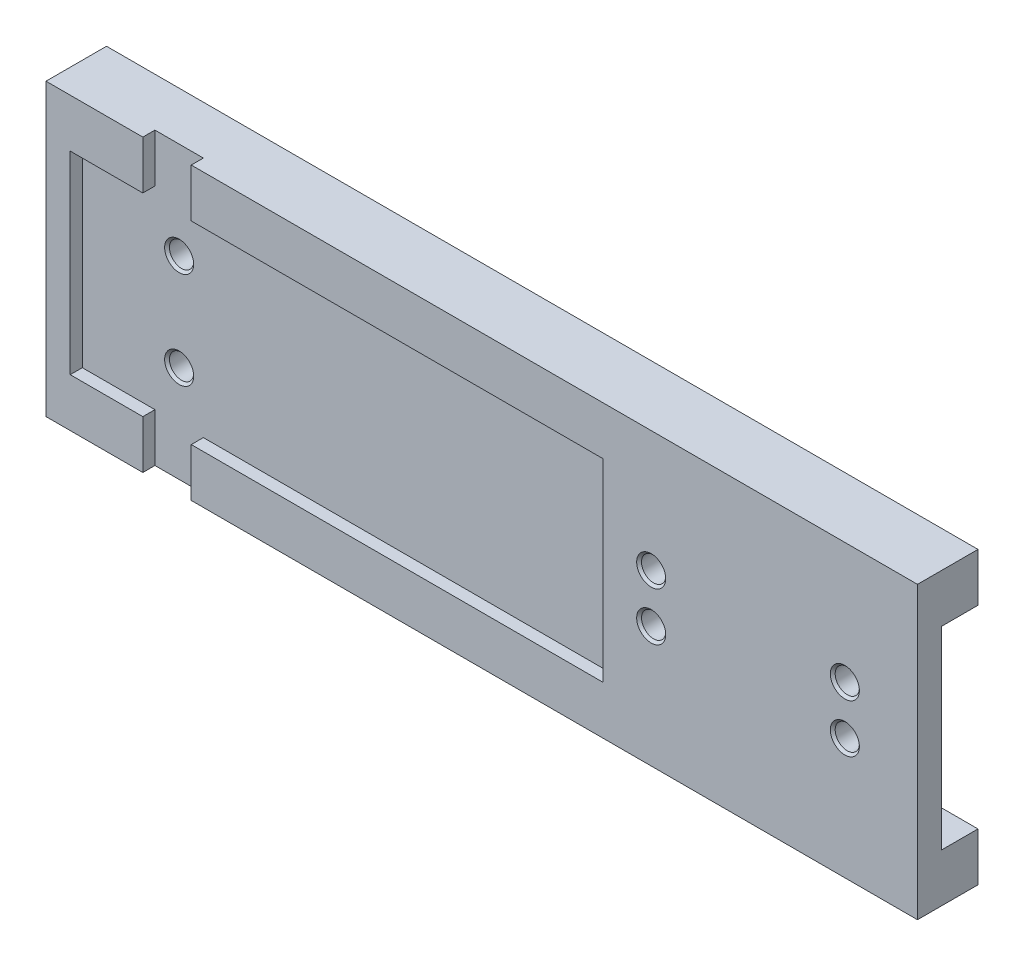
from build123d import *

# Parameters (mm, degrees)
SKETCH1_W                             = 228.6
SKETCH1_H                             = 76.2
BOSS_EXTRUDE1_DEPTH                   = 15.875
SKETCH3_W                             = 139.7
SKETCH3_H                             = 50.8
CUT_EXTRUDE1_DEPTH                    = 3.175
SKETCH4_W                             = 12.7
SKETCH4_H                             = 76.2
CUT_EXTRUDE2_DEPTH                    = 3.175
F_1_4_0_25_DIAMETER_HOLE2_D           = 6.35
F_1_4_0_25_DIAMETER_HOLE2_CSINK_D     = 7.62
F_1_4_0_25_DIAMETER_HOLE2_CSINK_ANGLE = 90
SKETCH10_W                            = 76.2
SKETCH10_H                            = 50.8
CUT_EXTRUDE4_DEPTH                    = 9.525
F_1_4_0_25_DIAMETER_HOLE5_D           = 6.35
F_1_4_0_25_DIAMETER_HOLE5_CSINK_D     = 7.62
F_1_4_0_25_DIAMETER_HOLE5_CSINK_ANGLE = 90


with BuildPart() as part:
    # Sketch1 → Boss-Extrude1 (new body)
    with BuildSketch(Plane.XY):
        with Locations((18.846205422, 8.613870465)):
            Rectangle(SKETCH1_W, SKETCH1_H)
    extrude(amount=BOSS_EXTRUDE1_DEPTH)

    # Sketch3 → Cut-Extrude1 (cut)
    with BuildSketch(Plane.XY.offset(15.875)):
        with Locations((-19.253794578, 8.613870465)):
            Rectangle(SKETCH3_W, SKETCH3_H)
    extrude(amount=-CUT_EXTRUDE1_DEPTH, mode=Mode.SUBTRACT)

    # Sketch4 → Cut-Extrude2 (cut)
    with BuildSketch(Plane.XY.offset(15.875)):
        with Locations((-63.703794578, 8.613870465)):
            Rectangle(SKETCH4_W, SKETCH4_H)
    extrude(amount=-CUT_EXTRUDE2_DEPTH, mode=Mode.SUBTRACT)

    # 1_4 _0.25_ Diameter Hole2 (through all)
    with Locations(Plane.XY.offset(12.7)):
        with Locations((-63.703794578, 21.313870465), (-63.703794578, -4.086129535)):
            CounterSinkHole(F_1_4_0_25_DIAMETER_HOLE2_D / 2, F_1_4_0_25_DIAMETER_HOLE2_CSINK_D / 2, counter_sink_angle=F_1_4_0_25_DIAMETER_HOLE2_CSINK_ANGLE)

    # Sketch10 → Cut-Extrude4 (cut)
    with BuildSketch(Plane(origin=(0, 0, 0), x_dir=(-1, 0, 0), z_dir=(0, 0, -1))):
        with Locations((-95.046205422, 8.613870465)):
            Rectangle(SKETCH10_W, SKETCH10_H)
    extrude(amount=-CUT_EXTRUDE4_DEPTH, mode=Mode.SUBTRACT)

    # 1_4 _0.25_ Diameter Hole5 (through all)
    with Locations(Plane.XY.offset(15.875)):
        with Locations((63.296205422, 14.963870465), (63.296205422, 2.263870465), (114.096205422, 2.229792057), (114.096205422, 14.963870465)):
            CounterSinkHole(F_1_4_0_25_DIAMETER_HOLE5_D / 2, F_1_4_0_25_DIAMETER_HOLE5_CSINK_D / 2, counter_sink_angle=F_1_4_0_25_DIAMETER_HOLE5_CSINK_ANGLE)


solid = part.part
